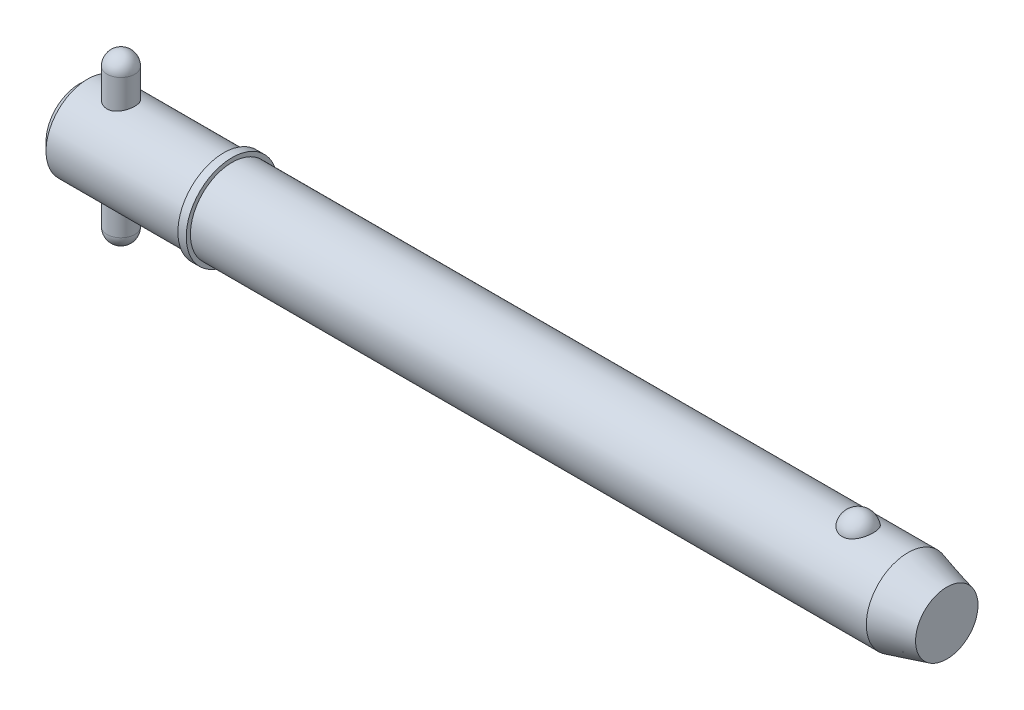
ISO-10303-21;
HEADER;
FILE_DESCRIPTION(('STEP AP214'),'2;1');
FILE_NAME('part.step','',(''),(''),'','','');
FILE_SCHEMA(('AUTOMOTIVE_DESIGN { 1 0 10303 214 1 1 1 1 }'));
ENDSEC;
DATA;
#1=APPLICATION_CONTEXT('core data for automotive mechanical design processes');
#2=APPLICATION_PROTOCOL_DEFINITION('international standard','automotive_design',2000,#1);
#3=PRODUCT_CONTEXT('',#1,'mechanical');
#4=PRODUCT('Part','Part','',(#3));
#5=PRODUCT_RELATED_PRODUCT_CATEGORY('part','',(#4));
#6=PRODUCT_DEFINITION_FORMATION('','',#4);
#7=PRODUCT_DEFINITION_CONTEXT('part definition',#1,'design');
#8=PRODUCT_DEFINITION('design','',#6,#7);
#9=PRODUCT_DEFINITION_SHAPE('','',#8);
#10=(LENGTH_UNIT() NAMED_UNIT(*) SI_UNIT(.MILLI.,.METRE.));
#11=(NAMED_UNIT(*) PLANE_ANGLE_UNIT() SI_UNIT($,.RADIAN.));
#12=(NAMED_UNIT(*) SI_UNIT($,.STERADIAN.) SOLID_ANGLE_UNIT());
#13=UNCERTAINTY_MEASURE_WITH_UNIT(LENGTH_MEASURE(1.E-05),#10,'distance_accuracy_value','');
#14=(GEOMETRIC_REPRESENTATION_CONTEXT(3) GLOBAL_UNCERTAINTY_ASSIGNED_CONTEXT((#13)) GLOBAL_UNIT_ASSIGNED_CONTEXT((#10,
#11,#12)) REPRESENTATION_CONTEXT('',''));
#15=CARTESIAN_POINT('',(0.,0.,0.));
#16=DIRECTION('',(0.,0.,1.));
#17=DIRECTION('',(1.,0.,0.));
#18=AXIS2_PLACEMENT_3D('',#15,#16,#17);
#19=CARTESIAN_POINT('',(9.525,19.05,0.));
#20=DIRECTION('',(0.,-1.,0.));
#21=DIRECTION('',(0.,0.,-1.));
#22=AXIS2_PLACEMENT_3D('',#19,#20,#21);
#23=CYLINDRICAL_SURFACE('',#22,3.175);
#24=CARTESIAN_POINT('',(9.525,-15.875,0.));
#25=DIRECTION('',(0.,-1.,0.));
#26=DIRECTION('',(0.,0.,-1.));
#27=AXIS2_PLACEMENT_3D('',#24,#25,#26);
#28=CIRCLE('',#27,3.175);
#29=CARTESIAN_POINT('',(9.525,-15.875,-3.175));
#30=VERTEX_POINT('',#29);
#31=EDGE_CURVE('P0_E10',#30,#30,#28,.F.);
#32=CARTESIAN_POINT('',(9.525,15.875,0.));
#33=DIRECTION('',(0.,-1.,0.));
#34=DIRECTION('',(0.,0.,-1.));
#35=AXIS2_PLACEMENT_3D('',#32,#33,#34);
#36=CIRCLE('',#35,3.175);
#37=CARTESIAN_POINT('',(9.525,15.875,-3.175));
#38=VERTEX_POINT('',#37);
#39=EDGE_CURVE('P0_E21',#38,#38,#36,.T.);
#40=CARTESIAN_POINT('',(9.525,-15.875,-3.175));
#41=CARTESIAN_POINT('',(9.525,-15.5442708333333,-3.175));
#42=CARTESIAN_POINT('',(9.525,-15.2135416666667,-3.175));
#43=CARTESIAN_POINT('',(9.525,-14.5520833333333,-3.175));
#44=CARTESIAN_POINT('',(9.525,-14.2213541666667,-3.175));
#45=CARTESIAN_POINT('',(9.525,-13.5598958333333,-3.175));
#46=CARTESIAN_POINT('',(9.525,-13.2291666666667,-3.175));
#47=CARTESIAN_POINT('',(9.525,-12.5677083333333,-3.175));
#48=CARTESIAN_POINT('',(9.525,-12.2369791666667,-3.175));
#49=CARTESIAN_POINT('',(9.525,-11.5755208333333,-3.175));
#50=CARTESIAN_POINT('',(9.525,-11.2447916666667,-3.175));
#51=CARTESIAN_POINT('',(9.525,-10.5833333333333,-3.175));
#52=CARTESIAN_POINT('',(9.525,-10.2526041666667,-3.175));
#53=CARTESIAN_POINT('',(9.525,-9.59114583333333,-3.175));
#54=CARTESIAN_POINT('',(9.525,-9.26041666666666,-3.175));
#55=CARTESIAN_POINT('',(9.525,-8.59895833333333,-3.175));
#56=CARTESIAN_POINT('',(9.525,-8.26822916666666,-3.175));
#57=CARTESIAN_POINT('',(9.525,-7.60677083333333,-3.175));
#58=CARTESIAN_POINT('',(9.525,-7.27604166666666,-3.175));
#59=CARTESIAN_POINT('',(9.525,-6.61458333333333,-3.175));
#60=CARTESIAN_POINT('',(9.525,-6.28385416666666,-3.175));
#61=CARTESIAN_POINT('',(9.525,-5.62239583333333,-3.175));
#62=CARTESIAN_POINT('',(9.525,-5.29166666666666,-3.175));
#63=CARTESIAN_POINT('',(9.525,-4.63020833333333,-3.175));
#64=CARTESIAN_POINT('',(9.525,-4.29947916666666,-3.175));
#65=CARTESIAN_POINT('',(9.525,-3.63802083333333,-3.175));
#66=CARTESIAN_POINT('',(9.525,-3.30729166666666,-3.175));
#67=CARTESIAN_POINT('',(9.525,-2.64583333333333,-3.175));
#68=CARTESIAN_POINT('',(9.525,-2.31510416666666,-3.175));
#69=CARTESIAN_POINT('',(9.525,-1.65364583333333,-3.175));
#70=CARTESIAN_POINT('',(9.525,-1.32291666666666,-3.175));
#71=CARTESIAN_POINT('',(9.525,-0.661458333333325,-3.175));
#72=CARTESIAN_POINT('',(9.525,-0.330729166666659,-3.175));
#73=CARTESIAN_POINT('',(9.525,0.330729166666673,-3.175));
#74=CARTESIAN_POINT('',(9.525,0.661458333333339,-3.175));
#75=CARTESIAN_POINT('',(9.525,1.32291666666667,-3.175));
#76=CARTESIAN_POINT('',(9.525,1.65364583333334,-3.175));
#77=CARTESIAN_POINT('',(9.525,2.31510416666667,-3.175));
#78=CARTESIAN_POINT('',(9.525,2.64583333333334,-3.175));
#79=CARTESIAN_POINT('',(9.525,3.30729166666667,-3.175));
#80=CARTESIAN_POINT('',(9.525,3.63802083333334,-3.175));
#81=CARTESIAN_POINT('',(9.525,4.29947916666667,-3.175));
#82=CARTESIAN_POINT('',(9.525,4.63020833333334,-3.175));
#83=CARTESIAN_POINT('',(9.525,5.29166666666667,-3.175));
#84=CARTESIAN_POINT('',(9.525,5.62239583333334,-3.175));
#85=CARTESIAN_POINT('',(9.525,6.28385416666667,-3.175));
#86=CARTESIAN_POINT('',(9.525,6.61458333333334,-3.175));
#87=CARTESIAN_POINT('',(9.525,7.27604166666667,-3.175));
#88=CARTESIAN_POINT('',(9.525,7.60677083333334,-3.175));
#89=CARTESIAN_POINT('',(9.525,8.26822916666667,-3.175));
#90=CARTESIAN_POINT('',(9.525,8.59895833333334,-3.175));
#91=CARTESIAN_POINT('',(9.525,9.26041666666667,-3.175));
#92=CARTESIAN_POINT('',(9.525,9.59114583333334,-3.175));
#93=CARTESIAN_POINT('',(9.525,10.2526041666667,-3.175));
#94=CARTESIAN_POINT('',(9.525,10.5833333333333,-3.175));
#95=CARTESIAN_POINT('',(9.525,11.2447916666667,-3.175));
#96=CARTESIAN_POINT('',(9.525,11.5755208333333,-3.175));
#97=CARTESIAN_POINT('',(9.525,12.2369791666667,-3.175));
#98=CARTESIAN_POINT('',(9.525,12.5677083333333,-3.175));
#99=CARTESIAN_POINT('',(9.525,13.2291666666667,-3.175));
#100=CARTESIAN_POINT('',(9.525,13.5598958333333,-3.175));
#101=CARTESIAN_POINT('',(9.525,14.2213541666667,-3.175));
#102=CARTESIAN_POINT('',(9.525,14.5520833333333,-3.175));
#103=CARTESIAN_POINT('',(9.525,15.2135416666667,-3.175));
#104=CARTESIAN_POINT('',(9.525,15.5442708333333,-3.175));
#105=CARTESIAN_POINT('',(9.525,15.875,-3.175));
#106=B_SPLINE_CURVE_WITH_KNOTS('',3,(#40,#41,#42,#43,#44,#45,#46,#47,#48,#49,#50,#51,#52,#53,
#54,#55,#56,#57,#58,#59,#60,#61,#62,#63,#64,#65,#66,#67,#68,#69,#70,#71,#72,#73,#74,#75,#76,#77,
#78,#79,#80,#81,#82,#83,#84,#85,#86,#87,#88,#89,#90,#91,#92,#93,#94,#95,#96,#97,#98,#99,#100,
#101,#102,#103,#104,#105),.UNSPECIFIED.,.F.,.F.,(4,2,2,2,2,2,2,2,2,2,2,2,2,2,2,2,2,2,2,2,2,2,2,
2,2,2,2,2,2,2,2,2,4),(0.,0.992187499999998,1.984375,2.9765625,3.96875,4.96093749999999,5.953125,
6.9453125,7.9375,8.92968749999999,9.921875,10.9140625,11.90625,12.8984375,13.890625,14.8828125,
15.875,16.8671875,17.859375,18.8515625,19.84375,20.8359375,21.828125,22.8203125,23.8125,
24.8046875,25.796875,26.7890625,27.78125,28.7734375,29.765625,30.7578125,31.75),.UNSPECIFIED.);
#107=EDGE_CURVE('P0_BSEAM14',#30,#38,#106,.T.);
#108=ORIENTED_EDGE('',*,*,#31,.T.);
#109=ORIENTED_EDGE('',*,*,#39,.T.);
#110=ORIENTED_EDGE('',*,*,#107,.T.);
#111=ORIENTED_EDGE('',*,*,#107,.F.);
#112=EDGE_LOOP('',(#108,#110,#109,#111));
#113=FACE_BOUND('',#112,.T.);
#114=ADVANCED_FACE('P0_F14',(#113),#23,.T.);
#115=CARTESIAN_POINT('',(9.525,-15.875,0.));
#116=DIRECTION('',(0.,0.,1.));
#117=DIRECTION('',(1.,0.,0.));
#118=AXIS2_PLACEMENT_3D('',#115,#116,#117);
#119=SPHERICAL_SURFACE('',#118,3.175);
#120=CARTESIAN_POINT('',(9.525,-15.875,0.));
#121=DIRECTION('',(0.,-1.,0.));
#122=DIRECTION('',(0.,0.,-1.));
#123=AXIS2_PLACEMENT_3D('',#120,#121,#122);
#124=SPHERICAL_SURFACE('',#123,3.175);
#125=ORIENTED_EDGE('',*,*,#31,.F.);
#126=EDGE_LOOP('',(#125));
#127=FACE_BOUND('',#126,.T.);
#128=ADVANCED_FACE('P0_F29',(#127),#124,.T.);
#129=CARTESIAN_POINT('',(9.525,15.875,0.));
#130=DIRECTION('',(0.,0.,1.));
#131=DIRECTION('',(1.,0.,0.));
#132=AXIS2_PLACEMENT_3D('',#129,#130,#131);
#133=SPHERICAL_SURFACE('',#132,3.175);
#134=CARTESIAN_POINT('',(9.525,15.875,0.));
#135=DIRECTION('',(0.,-1.,0.));
#136=DIRECTION('',(0.,0.,-1.));
#137=AXIS2_PLACEMENT_3D('',#134,#135,#136);
#138=SPHERICAL_SURFACE('',#137,3.175);
#139=ORIENTED_EDGE('',*,*,#39,.F.);
#140=EDGE_LOOP('',(#139));
#141=FACE_BOUND('',#140,.T.);
#142=ADVANCED_FACE('P0_F16',(#141),#138,.T.);
#143=CLOSED_SHELL('',(#114,#128,#142));
#144=MANIFOLD_SOLID_BREP('P0_B1',#143);
#145=CARTESIAN_POINT('',(0.,0.,0.));
#146=DIRECTION('',(1.,0.,0.));
#147=DIRECTION('',(0.,0.,-1.));
#148=AXIS2_PLACEMENT_3D('',#145,#146,#147);
#149=CYLINDRICAL_SURFACE('',#148,9.525);
#150=CARTESIAN_POINT('',(189.543054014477,0.,0.));
#151=DIRECTION('',(1.,0.,0.));
#152=DIRECTION('',(0.,0.,-1.));
#153=AXIS2_PLACEMENT_3D('',#150,#151,#152);
#154=CIRCLE('',#153,9.525);
#155=CARTESIAN_POINT('',(189.543054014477,0.,-9.525));
#156=VERTEX_POINT('',#155);
#157=EDGE_CURVE('P1_E81',#156,#156,#154,.T.);
#158=ORIENTED_EDGE('',*,*,#157,.F.);
#159=EDGE_LOOP('',(#158));
#160=FACE_BOUND('',#159,.T.);
#161=CARTESIAN_POINT('',(34.93,0.,0.));
#162=DIRECTION('',(1.,0.,0.));
#163=DIRECTION('',(0.,0.,-1.));
#164=AXIS2_PLACEMENT_3D('',#161,#162,#163);
#165=CIRCLE('',#164,9.525);
#166=CARTESIAN_POINT('',(34.93,0.,-9.525));
#167=VERTEX_POINT('',#166);
#168=EDGE_CURVE('P1_E85',#167,#167,#165,.T.);
#169=ORIENTED_EDGE('',*,*,#168,.T.);
#170=EDGE_LOOP('',(#169));
#171=FACE_BOUND('',#170,.T.);
#172=CARTESIAN_POINT('',(178.145757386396,8.80405803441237,3.63513233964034));
#173=CARTESIAN_POINT('',(178.051676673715,8.80405953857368,3.63513053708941));
#174=CARTESIAN_POINT('',(177.957561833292,8.80561325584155,3.63137461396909));
#175=CARTESIAN_POINT('',(177.770012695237,8.81177748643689,3.61638665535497));
#176=CARTESIAN_POINT('',(177.676578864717,8.81638992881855,3.60514990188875));
#177=CARTESIAN_POINT('',(177.397945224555,8.83467114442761,3.56024627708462));
#178=CARTESIAN_POINT('',(177.214691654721,8.85278327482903,3.5153862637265));
#179=CARTESIAN_POINT('',(176.859509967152,8.89871214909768,3.39742145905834));
#180=CARTESIAN_POINT('',(176.687553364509,8.92650327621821,3.32439116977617));
#181=CARTESIAN_POINT('',(176.358707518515,8.9887481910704,3.15220244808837));
#182=CARTESIAN_POINT('',(176.201811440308,9.02319893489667,3.05305594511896));
#183=CARTESIAN_POINT('',(175.902214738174,9.09629186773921,2.82797815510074));
#184=CARTESIAN_POINT('',(175.760060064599,9.13502685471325,2.70135138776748));
#185=CARTESIAN_POINT('',(175.498299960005,9.2118657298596,2.42641932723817));
#186=CARTESIAN_POINT('',(175.378701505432,9.24996941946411,2.27810735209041));
#187=CARTESIAN_POINT('',(175.159645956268,9.32341082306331,1.95652290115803));
#188=CARTESIAN_POINT('',(175.061317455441,9.35855090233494,1.78243511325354));
#189=CARTESIAN_POINT('',(174.893819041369,9.42045142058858,1.41937246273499));
#190=CARTESIAN_POINT('',(174.824651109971,9.44721128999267,1.23039658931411));
#191=CARTESIAN_POINT('',(174.716199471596,9.48990641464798,0.840370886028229));
#192=CARTESIAN_POINT('',(174.677288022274,9.50570658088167,0.639202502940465));
#193=CARTESIAN_POINT('',(174.631555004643,9.52433146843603,0.232664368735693));
#194=CARTESIAN_POINT('',(174.624732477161,9.52715657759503,0.0272947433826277));
#195=CARTESIAN_POINT('',(174.643255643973,9.51956918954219,-0.380478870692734));
#196=CARTESIAN_POINT('',(174.668405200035,9.50923740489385,-0.582893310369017));
#197=CARTESIAN_POINT('',(174.75002537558,9.47651897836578,-0.980293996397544));
#198=CARTESIAN_POINT('',(174.806496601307,9.45413210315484,-1.17528009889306));
#199=CARTESIAN_POINT('',(174.949719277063,9.39954044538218,-1.55263697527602));
#200=CARTESIAN_POINT('',(175.036512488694,9.36732213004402,-1.73498993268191));
#201=CARTESIAN_POINT('',(175.238610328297,9.29640700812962,-2.08177763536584));
#202=CARTESIAN_POINT('',(175.353917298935,9.25770966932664,-2.24621090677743));
#203=CARTESIAN_POINT('',(175.611264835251,9.17775604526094,-2.5533833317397));
#204=CARTESIAN_POINT('',(175.753434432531,9.136488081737,-2.696011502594));
#205=CARTESIAN_POINT('',(176.06089985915,9.05620497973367,-2.95451229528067));
#206=CARTESIAN_POINT('',(176.226193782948,9.01718965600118,-3.07038711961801));
#207=CARTESIAN_POINT('',(176.572052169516,8.94680019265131,-3.26976836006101));
#208=CARTESIAN_POINT('',(176.752227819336,8.91528408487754,-3.35389750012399));
#209=CARTESIAN_POINT('',(177.125651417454,8.86272514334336,-3.49043503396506));
#210=CARTESIAN_POINT('',(177.318894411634,8.84167836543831,-3.54285537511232));
#211=CARTESIAN_POINT('',(177.702503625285,8.81348056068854,-3.61241306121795));
#212=CARTESIAN_POINT('',(177.892525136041,8.80568348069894,-3.6311933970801));
#213=CARTESIAN_POINT('',(178.273190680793,8.80289410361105,-3.63795342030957));
#214=CARTESIAN_POINT('',(178.463834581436,8.80789922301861,-3.62593932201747));
#215=CARTESIAN_POINT('',(178.834007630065,8.82974915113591,-3.57238430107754));
#216=CARTESIAN_POINT('',(179.013697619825,8.84621463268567,-3.53178890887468));
#217=CARTESIAN_POINT('',(179.363422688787,8.88875330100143,-3.42331083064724));
#218=CARTESIAN_POINT('',(179.533456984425,8.91482726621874,-3.35542593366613));
#219=CARTESIAN_POINT('',(179.863237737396,8.97448239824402,-3.19248225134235));
#220=CARTESIAN_POINT('',(180.022680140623,9.00821446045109,-3.0968647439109));
#221=CARTESIAN_POINT('',(180.323513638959,9.07935398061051,-2.88162736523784));
#222=CARTESIAN_POINT('',(180.464900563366,9.11676228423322,-2.76200196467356));
#223=CARTESIAN_POINT('',(180.73331931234,9.19347419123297,-2.49516285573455));
#224=CARTESIAN_POINT('',(180.859275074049,9.23277872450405,-2.34686614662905));
#225=CARTESIAN_POINT('',(181.085522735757,9.3073761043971,-2.03093683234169));
#226=CARTESIAN_POINT('',(181.18581004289,9.34266823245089,-1.86330077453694));
#227=CARTESIAN_POINT('',(181.361514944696,9.40674710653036,-1.50744893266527));
#228=CARTESIAN_POINT('',(181.436041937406,9.43529176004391,-1.31874876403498));
#229=CARTESIAN_POINT('',(181.55416505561,9.48144132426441,-0.930631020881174));
#230=CARTESIAN_POINT('',(181.597760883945,9.49904612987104,-0.731213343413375));
#231=CARTESIAN_POINT('',(181.653158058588,9.5215314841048,-0.327147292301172));
#232=CARTESIAN_POINT('',(181.664935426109,9.52640243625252,-0.122495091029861));
#233=CARTESIAN_POINT('',(181.656382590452,9.5228957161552,0.28601848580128));
#234=CARTESIAN_POINT('',(181.63605305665,9.5145183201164,0.489879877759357));
#235=CARTESIAN_POINT('',(181.563884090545,9.48544083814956,0.889994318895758));
#236=CARTESIAN_POINT('',(181.512199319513,9.46480124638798,1.08627971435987));
#237=CARTESIAN_POINT('',(181.378491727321,9.4133389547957,1.46682086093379));
#238=CARTESIAN_POINT('',(181.296466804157,9.38251554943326,1.65107577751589));
#239=CARTESIAN_POINT('',(181.10319292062,9.31365636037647,2.00346348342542));
#240=CARTESIAN_POINT('',(180.991783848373,9.27558138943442,2.17150083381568));
#241=CARTESIAN_POINT('',(180.742294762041,9.19638714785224,2.48563115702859));
#242=CARTESIAN_POINT('',(180.604216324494,9.15526805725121,2.63172542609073));
#243=CARTESIAN_POINT('',(180.304843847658,9.07465393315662,2.89750997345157));
#244=CARTESIAN_POINT('',(180.143610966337,9.03515496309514,3.01726776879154));
#245=CARTESIAN_POINT('',(179.801613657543,8.96227564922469,3.22732920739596));
#246=CARTESIAN_POINT('',(179.620841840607,8.92889763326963,3.31762165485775));
#247=CARTESIAN_POINT('',(179.251445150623,8.8734538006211,3.46314419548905));
#248=CARTESIAN_POINT('',(179.06332371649,8.85102983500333,3.51950082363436));
#249=CARTESIAN_POINT('',(178.77578699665,8.8266696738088,3.57993683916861));
#250=CARTESIAN_POINT('',(178.679133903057,8.82009725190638,3.5960621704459));
#251=CARTESIAN_POINT('',(178.484677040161,8.81020897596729,3.62022512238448));
#252=CARTESIAN_POINT('',(178.386874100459,8.80689090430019,3.62826825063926));
#253=CARTESIAN_POINT('',(178.241224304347,8.80445615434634,3.63416760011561));
#254=CARTESIAN_POINT('',(178.193495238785,8.80405727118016,3.63513325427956));
#255=CARTESIAN_POINT('',(178.145757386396,8.80405803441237,3.63513233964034));
#256=B_SPLINE_CURVE_WITH_KNOTS('',3,(#172,#173,#174,#175,#176,#177,#178,#179,#180,#181,#182,
#183,#184,#185,#186,#187,#188,#189,#190,#191,#192,#193,#194,#195,#196,#197,#198,#199,#200,#201,
#202,#203,#204,#205,#206,#207,#208,#209,#210,#211,#212,#213,#214,#215,#216,#217,#218,#219,#220,
#221,#222,#223,#224,#225,#226,#227,#228,#229,#230,#231,#232,#233,#234,#235,#236,#237,#238,#239,
#240,#241,#242,#243,#244,#245,#246,#247,#248,#249,#250,#251,#252,#253,#254,#255),.UNSPECIFIED.,
.T.,.F.,(4,2,2,2,2,2,2,2,2,2,2,2,2,2,2,2,2,2,2,2,2,2,2,2,2,2,2,2,2,2,2,2,2,2,2,2,2,2,2,2,2,4),
(0.,0.282202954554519,0.564584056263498,1.13017050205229,1.69427128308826,2.25811483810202,
2.83836627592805,3.41879688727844,4.02497117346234,4.63118665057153,5.24474754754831,
5.85829010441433,6.46808687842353,7.07789545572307,7.68854723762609,8.299249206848,
8.91296283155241,9.52662591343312,10.1275338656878,10.7282152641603,11.2986646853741,
11.8689989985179,12.4213015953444,12.973648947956,13.5380053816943,14.1024919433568,
14.695298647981,15.2882113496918,15.8999469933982,16.5116885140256,17.1238909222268,
17.7360805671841,18.3452748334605,18.9545113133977,19.567138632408,20.179729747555,
20.7907316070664,21.4019653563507,21.9915938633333,22.2859053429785,22.5800161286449,
22.7232098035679),.UNSPECIFIED.);
#257=CARTESIAN_POINT('',(178.145757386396,8.80405803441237,3.63513233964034));
#258=VERTEX_POINT('',#257);
#259=EDGE_CURVE('P1_E35',#258,#258,#256,.T.);
#260=ORIENTED_EDGE('',*,*,#259,.T.);
#261=EDGE_LOOP('',(#260));
#262=FACE_BOUND('',#261,.T.);
#263=ADVANCED_FACE('P1_F13',(#160,#171,#262),#149,.T.);
#264=CARTESIAN_POINT('',(0.,0.,0.));
#265=DIRECTION('',(-1.,0.,0.));
#266=DIRECTION('',(0.,0.,1.));
#267=AXIS2_PLACEMENT_3D('',#264,#265,#266);
#268=PLANE('',#267);
#269=CARTESIAN_POINT('',(0.,0.,0.));
#270=DIRECTION('',(1.,0.,0.));
#271=DIRECTION('',(0.,0.,-1.));
#272=AXIS2_PLACEMENT_3D('',#269,#270,#271);
#273=CIRCLE('',#272,7.62);
#274=CARTESIAN_POINT('',(0.,0.,-7.62));
#275=VERTEX_POINT('',#274);
#276=EDGE_CURVE('P1_E9',#275,#275,#273,.T.);
#277=ORIENTED_EDGE('',*,*,#276,.F.);
#278=EDGE_LOOP('',(#277));
#279=FACE_BOUND('',#278,.T.);
#280=ADVANCED_FACE('P1_F15',(#279),#268,.T.);
#281=CARTESIAN_POINT('',(1.90499999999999,0.,0.));
#282=DIRECTION('',(1.,0.,0.));
#283=DIRECTION('',(0.,0.,-1.));
#284=AXIS2_PLACEMENT_3D('',#281,#282,#283);
#285=CONICAL_SURFACE('',#284,9.525,0.785398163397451);
#286=ORIENTED_EDGE('',*,*,#276,.T.);
#287=EDGE_LOOP('',(#286));
#288=FACE_BOUND('',#287,.T.);
#289=CARTESIAN_POINT('',(1.90499999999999,0.,0.));
#290=DIRECTION('',(1.,0.,0.));
#291=DIRECTION('',(0.,0.,-1.));
#292=AXIS2_PLACEMENT_3D('',#289,#290,#291);
#293=CIRCLE('',#292,9.525);
#294=CARTESIAN_POINT('',(1.90499999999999,0.,-9.525));
#295=VERTEX_POINT('',#294);
#296=EDGE_CURVE('P1_E26',#295,#295,#293,.T.);
#297=ORIENTED_EDGE('',*,*,#296,.F.);
#298=EDGE_LOOP('',(#297));
#299=FACE_BOUND('',#298,.T.);
#300=ADVANCED_FACE('P1_F77',(#288,#299),#285,.T.);
#301=CARTESIAN_POINT('',(0.,0.,0.));
#302=DIRECTION('',(1.,0.,0.));
#303=DIRECTION('',(0.,0.,-1.));
#304=AXIS2_PLACEMENT_3D('',#301,#302,#303);
#305=CYLINDRICAL_SURFACE('',#304,9.525);
#306=CARTESIAN_POINT('',(9.525,-8.98025612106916,3.175));
#307=CARTESIAN_POINT('',(9.35206354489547,-8.98025555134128,3.17500081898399));
#308=CARTESIAN_POINT('',(9.17913201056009,-8.98530617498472,3.16082293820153));
#309=CARTESIAN_POINT('',(8.83839221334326,-9.00485797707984,3.10467734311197));
#310=CARTESIAN_POINT('',(8.67058479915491,-9.0193607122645,3.06270505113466));
#311=CARTESIAN_POINT('',(8.34508461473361,-9.05599546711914,2.95260866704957));
#312=CARTESIAN_POINT('',(8.18737272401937,-9.07811252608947,2.88453582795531));
#313=CARTESIAN_POINT('',(7.88555684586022,-9.12746212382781,2.72434567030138));
#314=CARTESIAN_POINT('',(7.74145587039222,-9.1546957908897,2.63222304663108));
#315=CARTESIAN_POINT('',(7.46531411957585,-9.21240503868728,2.42268738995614));
#316=CARTESIAN_POINT('',(7.33388351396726,-9.24296141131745,2.30449228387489));
#317=CARTESIAN_POINT('',(7.09229340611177,-9.30319020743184,2.0478358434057));
#318=CARTESIAN_POINT('',(6.98213731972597,-9.33286248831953,1.90937126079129));
#319=CARTESIAN_POINT('',(6.78345450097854,-9.38891527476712,1.61164431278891));
#320=CARTESIAN_POINT('',(6.69556709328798,-9.41518969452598,1.45193356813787));
#321=CARTESIAN_POINT('',(6.54814671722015,-9.46053437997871,1.11896913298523));
#322=CARTESIAN_POINT('',(6.48860610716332,-9.47960658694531,0.945719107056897));
#323=CARTESIAN_POINT('',(6.40163866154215,-9.50782564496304,0.596991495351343));
#324=CARTESIAN_POINT('',(6.373166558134,-9.5172947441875,0.421801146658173));
#325=CARTESIAN_POINT('',(6.3458207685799,-9.52638456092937,0.068890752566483));
#326=CARTESIAN_POINT('',(6.34693945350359,-9.52600781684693,-0.108828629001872));
#327=CARTESIAN_POINT('',(6.37808050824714,-9.51566675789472,-0.454353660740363));
#328=CARTESIAN_POINT('',(6.4069675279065,-9.50607905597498,-0.622274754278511));
#329=CARTESIAN_POINT('',(6.490947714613,-9.47886621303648,-0.950732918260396));
#330=CARTESIAN_POINT('',(6.54604265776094,-9.46124052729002,-1.11126948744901));
#331=CARTESIAN_POINT('',(6.68153768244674,-9.41945253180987,-1.42288410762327));
#332=CARTESIAN_POINT('',(6.76226085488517,-9.3952073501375,-1.57381010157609));
#333=CARTESIAN_POINT('',(6.94645456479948,-9.34270397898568,-1.86030973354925));
#334=CARTESIAN_POINT('',(7.04993142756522,-9.31444467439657,-1.99587908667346));
#335=CARTESIAN_POINT('',(7.28241619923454,-9.25532159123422,-2.2545702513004));
#336=CARTESIAN_POINT('',(7.4123967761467,-9.22439783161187,-2.37680549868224));
#337=CARTESIAN_POINT('',(7.69127470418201,-9.1645528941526,-2.5980302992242));
#338=CARTESIAN_POINT('',(7.84017496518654,-9.13563202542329,-2.6970162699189));
#339=CARTESIAN_POINT('',(8.15547526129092,-9.08273917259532,-2.87016016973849));
#340=CARTESIAN_POINT('',(8.32209451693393,-9.05884361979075,-2.94394402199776));
#341=CARTESIAN_POINT('',(8.66638917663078,-9.01959241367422,-3.06210713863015));
#342=CARTESIAN_POINT('',(8.84405991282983,-9.00423318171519,-3.10649872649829));
#343=CARTESIAN_POINT('',(9.19682677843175,-8.98460345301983,-3.16281207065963));
#344=CARTESIAN_POINT('',(9.37167742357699,-8.9798639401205,-3.17610837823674));
#345=CARTESIAN_POINT('',(9.72113927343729,-8.9806993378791,-3.17374726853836));
#346=CARTESIAN_POINT('',(9.89575051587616,-8.98627237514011,-3.15809511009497));
#347=CARTESIAN_POINT('',(10.2335233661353,-9.00663737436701,-3.09951644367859));
#348=CARTESIAN_POINT('',(10.3968722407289,-9.02110608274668,-3.05754530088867));
#349=CARTESIAN_POINT('',(10.7141759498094,-9.05727657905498,-2.94866651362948));
#350=CARTESIAN_POINT('',(10.8681291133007,-9.07897964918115,-2.88175444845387));
#351=CARTESIAN_POINT('',(11.1676828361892,-9.12802586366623,-2.72248103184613));
#352=CARTESIAN_POINT('',(11.3128635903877,-9.1555260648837,-2.62937980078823));
#353=CARTESIAN_POINT('',(11.5860387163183,-9.21276315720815,-2.42120937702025));
#354=CARTESIAN_POINT('',(11.7140280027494,-9.24250070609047,-2.30613370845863));
#355=CARTESIAN_POINT('',(11.9555513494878,-9.30259247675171,-2.05070616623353));
#356=CARTESIAN_POINT('',(12.0680936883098,-9.33290753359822,-1.90940458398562));
#357=CARTESIAN_POINT('',(12.267933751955,-9.3893275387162,-1.60917665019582));
#358=CARTESIAN_POINT('',(12.3552323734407,-9.41543263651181,-1.45025092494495));
#359=CARTESIAN_POINT('',(12.5013088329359,-9.46036988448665,-1.12007606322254));
#360=CARTESIAN_POINT('',(12.5602723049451,-9.47924920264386,-0.9489158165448));
#361=CARTESIAN_POINT('',(12.6483355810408,-9.50781089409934,-0.598355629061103));
#362=CARTESIAN_POINT('',(12.6774461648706,-9.5174965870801,-0.4189586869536));
#363=CARTESIAN_POINT('',(12.7040070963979,-9.52632915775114,-0.066088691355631));
#364=CARTESIAN_POINT('',(12.7028811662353,-9.52594996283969,0.107266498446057));
#365=CARTESIAN_POINT('',(12.6725130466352,-9.51586223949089,0.451202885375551));
#366=CARTESIAN_POINT('',(12.643273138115,-9.50615446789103,0.621784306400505));
#367=CARTESIAN_POINT('',(12.5584514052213,-9.47867404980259,0.952633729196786));
#368=CARTESIAN_POINT('',(12.5032953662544,-9.46103195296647,1.1130225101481));
#369=CARTESIAN_POINT('',(12.3686013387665,-9.41949985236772,1.42233126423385));
#370=CARTESIAN_POINT('',(12.2890589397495,-9.39560871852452,1.57124915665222));
#371=CARTESIAN_POINT('',(12.1044667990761,-9.34294133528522,1.85938800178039));
#372=CARTESIAN_POINT('',(11.9985831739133,-9.31401720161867,1.9980473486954));
#373=CARTESIAN_POINT('',(11.7657327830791,-9.25490239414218,2.25609475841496));
#374=CARTESIAN_POINT('',(11.6387592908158,-9.22471131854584,2.37547664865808));
#375=CARTESIAN_POINT('',(11.3613902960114,-9.16505913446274,2.59633024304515));
#376=CARTESIAN_POINT('',(11.2102725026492,-9.13567286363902,2.69691791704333));
#377=CARTESIAN_POINT('',(10.8923631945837,-9.08241113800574,2.87119803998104));
#378=CARTESIAN_POINT('',(10.7255757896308,-9.05853424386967,2.94489751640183));
#379=CARTESIAN_POINT('',(10.3887212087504,-9.02021736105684,3.06020415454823));
#380=CARTESIAN_POINT('',(10.219143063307,-9.00539959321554,3.10311136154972));
#381=CARTESIAN_POINT('',(9.87470703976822,-8.98542092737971,3.16050396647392));
#382=CARTESIAN_POINT('',(9.699851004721,-8.98025669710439,3.17499917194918));
#383=CARTESIAN_POINT('',(9.525,-8.98025612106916,3.175));
#384=B_SPLINE_CURVE_WITH_KNOTS('',3,(#306,#307,#308,#309,#310,#311,#312,#313,#314,#315,#316,
#317,#318,#319,#320,#321,#322,#323,#324,#325,#326,#327,#328,#329,#330,#331,#332,#333,#334,#335,
#336,#337,#338,#339,#340,#341,#342,#343,#344,#345,#346,#347,#348,#349,#350,#351,#352,#353,#354,
#355,#356,#357,#358,#359,#360,#361,#362,#363,#364,#365,#366,#367,#368,#369,#370,#371,#372,#373,
#374,#375,#376,#377,#378,#379,#380,#381,#382,#383),.UNSPECIFIED.,.T.,.F.,(4,2,2,2,2,2,2,2,2,2,2,
2,2,2,2,2,2,2,2,2,2,2,2,2,2,2,2,2,2,2,2,2,2,2,2,2,2,2,4),(0.,0.518161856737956,1.03640907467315,
1.55364379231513,2.07099270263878,2.60671746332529,3.14252816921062,3.69231882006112,
4.24196117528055,4.77247962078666,5.30286129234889,5.81244090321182,6.32205505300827,
6.83836754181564,7.3548237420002,7.89559553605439,8.43645060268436,8.98501631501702,
9.53335188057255,10.056948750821,10.5804505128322,11.0859695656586,11.5915782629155,
12.1132237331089,12.6350231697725,13.1819271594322,13.7288117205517,14.2720628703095,
14.815117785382,15.3326491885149,15.8501386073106,16.3594083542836,16.868770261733,
17.3969527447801,17.925304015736,18.4743376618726,19.023227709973,19.5473069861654,
20.0712053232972),.UNSPECIFIED.);
#385=CARTESIAN_POINT('',(9.525,-8.98025612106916,3.175));
#386=VERTEX_POINT('',#385);
#387=EDGE_CURVE('P1_E17',#386,#386,#384,.T.);
#388=ORIENTED_EDGE('',*,*,#387,.F.);
#389=EDGE_LOOP('',(#388));
#390=FACE_BOUND('',#389,.T.);
#391=CARTESIAN_POINT('',(9.525,8.98025612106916,3.175));
#392=CARTESIAN_POINT('',(9.69793645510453,8.98025555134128,3.17500081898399));
#393=CARTESIAN_POINT('',(9.87086798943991,8.98530617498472,3.16082293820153));
#394=CARTESIAN_POINT('',(10.2116077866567,9.00485797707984,3.10467734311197));
#395=CARTESIAN_POINT('',(10.3794152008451,9.0193607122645,3.06270505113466));
#396=CARTESIAN_POINT('',(10.7049153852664,9.05599546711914,2.95260866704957));
#397=CARTESIAN_POINT('',(10.8626272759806,9.07811252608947,2.88453582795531));
#398=CARTESIAN_POINT('',(11.1644431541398,9.12746212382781,2.72434567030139));
#399=CARTESIAN_POINT('',(11.3085441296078,9.15469579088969,2.63222304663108));
#400=CARTESIAN_POINT('',(11.5846858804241,9.21240503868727,2.42268738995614));
#401=CARTESIAN_POINT('',(11.7161164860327,9.24296141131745,2.30449228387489));
#402=CARTESIAN_POINT('',(11.9577065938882,9.30319020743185,2.0478358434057));
#403=CARTESIAN_POINT('',(12.067862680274,9.33286248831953,1.90937126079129));
#404=CARTESIAN_POINT('',(12.2665454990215,9.38891527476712,1.61164431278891));
#405=CARTESIAN_POINT('',(12.354432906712,9.41518969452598,1.45193356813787));
#406=CARTESIAN_POINT('',(12.5018532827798,9.46053437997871,1.11896913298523));
#407=CARTESIAN_POINT('',(12.5613938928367,9.47960658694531,0.945719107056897));
#408=CARTESIAN_POINT('',(12.6483613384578,9.50782564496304,0.596991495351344));
#409=CARTESIAN_POINT('',(12.676833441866,9.5172947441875,0.421801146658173));
#410=CARTESIAN_POINT('',(12.7041792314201,9.52638456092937,0.0688907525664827));
#411=CARTESIAN_POINT('',(12.7030605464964,9.52600781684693,-0.108828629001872));
#412=CARTESIAN_POINT('',(12.6719194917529,9.51566675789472,-0.454353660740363));
#413=CARTESIAN_POINT('',(12.6430324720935,9.50607905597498,-0.622274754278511));
#414=CARTESIAN_POINT('',(12.559052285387,9.47886621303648,-0.950732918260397));
#415=CARTESIAN_POINT('',(12.5039573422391,9.46124052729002,-1.11126948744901));
#416=CARTESIAN_POINT('',(12.3684623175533,9.41945253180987,-1.42288410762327));
#417=CARTESIAN_POINT('',(12.2877391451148,9.3952073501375,-1.57381010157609));
#418=CARTESIAN_POINT('',(12.1035454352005,9.34270397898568,-1.86030973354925));
#419=CARTESIAN_POINT('',(12.0000685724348,9.31444467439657,-1.99587908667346));
#420=CARTESIAN_POINT('',(11.7675838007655,9.25532159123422,-2.2545702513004));
#421=CARTESIAN_POINT('',(11.6376032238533,9.22439783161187,-2.37680549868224));
#422=CARTESIAN_POINT('',(11.358725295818,9.1645528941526,-2.5980302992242));
#423=CARTESIAN_POINT('',(11.2098250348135,9.13563202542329,-2.6970162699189));
#424=CARTESIAN_POINT('',(10.8945247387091,9.08273917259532,-2.87016016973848));
#425=CARTESIAN_POINT('',(10.7279054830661,9.05884361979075,-2.94394402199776));
#426=CARTESIAN_POINT('',(10.3836108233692,9.01959241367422,-3.06210713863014));
#427=CARTESIAN_POINT('',(10.2059400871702,9.00423318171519,-3.10649872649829));
#428=CARTESIAN_POINT('',(9.85317322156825,8.98460345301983,-3.16281207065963));
#429=CARTESIAN_POINT('',(9.67832257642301,8.9798639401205,-3.17610837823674));
#430=CARTESIAN_POINT('',(9.32886072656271,8.9806993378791,-3.17374726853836));
#431=CARTESIAN_POINT('',(9.15424948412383,8.98627237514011,-3.15809511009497));
#432=CARTESIAN_POINT('',(8.81647663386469,9.00663737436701,-3.09951644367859));
#433=CARTESIAN_POINT('',(8.65312775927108,9.02110608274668,-3.05754530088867));
#434=CARTESIAN_POINT('',(8.33582405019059,9.05727657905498,-2.94866651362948));
#435=CARTESIAN_POINT('',(8.18187088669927,9.07897964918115,-2.88175444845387));
#436=CARTESIAN_POINT('',(7.88231716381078,9.12802586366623,-2.72248103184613));
#437=CARTESIAN_POINT('',(7.73713640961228,9.1555260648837,-2.62937980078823));
#438=CARTESIAN_POINT('',(7.46396128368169,9.21276315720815,-2.42120937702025));
#439=CARTESIAN_POINT('',(7.33597199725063,9.24250070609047,-2.30613370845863));
#440=CARTESIAN_POINT('',(7.09444865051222,9.30259247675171,-2.05070616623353));
#441=CARTESIAN_POINT('',(6.98190631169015,9.33290753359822,-1.90940458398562));
#442=CARTESIAN_POINT('',(6.78206624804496,9.3893275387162,-1.60917665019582));
#443=CARTESIAN_POINT('',(6.6947676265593,9.41543263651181,-1.45025092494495));
#444=CARTESIAN_POINT('',(6.54869116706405,9.46036988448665,-1.12007606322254));
#445=CARTESIAN_POINT('',(6.48972769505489,9.47924920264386,-0.948915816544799));
#446=CARTESIAN_POINT('',(6.40166441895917,9.50781089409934,-0.598355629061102));
#447=CARTESIAN_POINT('',(6.3725538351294,9.5174965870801,-0.418958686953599));
#448=CARTESIAN_POINT('',(6.34599290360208,9.52632915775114,-0.0660886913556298));
#449=CARTESIAN_POINT('',(6.3471188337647,9.52594996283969,0.107266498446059));
#450=CARTESIAN_POINT('',(6.37748695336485,9.51586223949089,0.451202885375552));
#451=CARTESIAN_POINT('',(6.40672686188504,9.50615446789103,0.621784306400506));
#452=CARTESIAN_POINT('',(6.49154859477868,9.47867404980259,0.952633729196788));
#453=CARTESIAN_POINT('',(6.54670463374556,9.46103195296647,1.11302251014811));
#454=CARTESIAN_POINT('',(6.68139866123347,9.41949985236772,1.42233126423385));
#455=CARTESIAN_POINT('',(6.76094106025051,9.39560871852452,1.57124915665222));
#456=CARTESIAN_POINT('',(6.94553320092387,9.34294133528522,1.85938800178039));
#457=CARTESIAN_POINT('',(7.05141682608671,9.31401720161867,1.9980473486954));
#458=CARTESIAN_POINT('',(7.28426721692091,9.25490239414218,2.25609475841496));
#459=CARTESIAN_POINT('',(7.41124070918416,9.22471131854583,2.37547664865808));
#460=CARTESIAN_POINT('',(7.68860970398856,9.16505913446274,2.59633024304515));
#461=CARTESIAN_POINT('',(7.83972749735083,9.13567286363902,2.69691791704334));
#462=CARTESIAN_POINT('',(8.15763680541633,9.08241113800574,2.87119803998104));
#463=CARTESIAN_POINT('',(8.32442421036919,9.05853424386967,2.94489751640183));
#464=CARTESIAN_POINT('',(8.66127879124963,9.02021736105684,3.06020415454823));
#465=CARTESIAN_POINT('',(8.83085693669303,9.00539959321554,3.10311136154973));
#466=CARTESIAN_POINT('',(9.17529296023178,8.98542092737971,3.16050396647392));
#467=CARTESIAN_POINT('',(9.350148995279,8.98025669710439,3.17499917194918));
#468=CARTESIAN_POINT('',(9.525,8.98025612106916,3.175));
#469=B_SPLINE_CURVE_WITH_KNOTS('',3,(#391,#392,#393,#394,#395,#396,#397,#398,#399,#400,#401,
#402,#403,#404,#405,#406,#407,#408,#409,#410,#411,#412,#413,#414,#415,#416,#417,#418,#419,#420,
#421,#422,#423,#424,#425,#426,#427,#428,#429,#430,#431,#432,#433,#434,#435,#436,#437,#438,#439,
#440,#441,#442,#443,#444,#445,#446,#447,#448,#449,#450,#451,#452,#453,#454,#455,#456,#457,#458,
#459,#460,#461,#462,#463,#464,#465,#466,#467,#468),.UNSPECIFIED.,.T.,.F.,(4,2,2,2,2,2,2,2,2,2,2,
2,2,2,2,2,2,2,2,2,2,2,2,2,2,2,2,2,2,2,2,2,2,2,2,2,2,2,4),(0.,0.518161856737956,1.03640907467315,
1.55364379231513,2.07099270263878,2.60671746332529,3.14252816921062,3.69231882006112,
4.24196117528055,4.77247962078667,5.30286129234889,5.81244090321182,6.32205505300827,
6.83836754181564,7.3548237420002,7.89559553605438,8.43645060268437,8.98501631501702,
9.53335188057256,10.056948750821,10.5804505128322,11.0859695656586,11.5915782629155,
12.1132237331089,12.6350231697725,13.1819271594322,13.7288117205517,14.2720628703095,
14.815117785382,15.3326491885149,15.8501386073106,16.3594083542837,16.868770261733,
17.3969527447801,17.9253040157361,18.4743376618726,19.023227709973,19.5473069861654,
20.0712053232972),.UNSPECIFIED.);
#470=CARTESIAN_POINT('',(9.525,8.98025612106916,3.175));
#471=VERTEX_POINT('',#470);
#472=EDGE_CURVE('P1_E43',#471,#471,#469,.T.);
#473=ORIENTED_EDGE('',*,*,#472,.F.);
#474=EDGE_LOOP('',(#473));
#475=FACE_BOUND('',#474,.T.);
#476=ORIENTED_EDGE('',*,*,#296,.T.);
#477=EDGE_LOOP('',(#476));
#478=FACE_BOUND('',#477,.T.);
#479=CARTESIAN_POINT('',(33.025,0.,0.));
#480=DIRECTION('',(1.,0.,0.));
#481=DIRECTION('',(0.,0.,-1.));
#482=AXIS2_PLACEMENT_3D('',#479,#480,#481);
#483=CIRCLE('',#482,9.525);
#484=CARTESIAN_POINT('',(33.025,0.,-9.525));
#485=VERTEX_POINT('',#484);
#486=EDGE_CURVE('P1_E31',#485,#485,#483,.T.);
#487=ORIENTED_EDGE('',*,*,#486,.F.);
#488=EDGE_LOOP('',(#487));
#489=FACE_BOUND('',#488,.T.);
#490=ADVANCED_FACE('P1_F103',(#390,#475,#478,#489),#305,.T.);
#491=CARTESIAN_POINT('',(33.025,9.525,0.));
#492=DIRECTION('',(-1.,0.,0.));
#493=DIRECTION('',(0.,0.,1.));
#494=AXIS2_PLACEMENT_3D('',#491,#492,#493);
#495=PLANE('',#494);
#496=ORIENTED_EDGE('',*,*,#486,.T.);
#497=EDGE_LOOP('',(#496));
#498=FACE_BOUND('',#497,.T.);
#499=CARTESIAN_POINT('',(33.025,0.,0.));
#500=DIRECTION('',(1.,0.,0.));
#501=DIRECTION('',(0.,0.,-1.));
#502=AXIS2_PLACEMENT_3D('',#499,#500,#501);
#503=CIRCLE('',#502,10.4775);
#504=CARTESIAN_POINT('',(33.025,0.,-10.4775));
#505=VERTEX_POINT('',#504);
#506=EDGE_CURVE('P1_E91',#505,#505,#503,.T.);
#507=ORIENTED_EDGE('',*,*,#506,.F.);
#508=EDGE_LOOP('',(#507));
#509=FACE_BOUND('',#508,.T.);
#510=ADVANCED_FACE('P1_F100',(#498,#509),#495,.T.);
#511=CARTESIAN_POINT('',(0.,0.,0.));
#512=DIRECTION('',(1.,0.,0.));
#513=DIRECTION('',(0.,0.,-1.));
#514=AXIS2_PLACEMENT_3D('',#511,#512,#513);
#515=CYLINDRICAL_SURFACE('',#514,10.4775);
#516=ORIENTED_EDGE('',*,*,#506,.T.);
#517=EDGE_LOOP('',(#516));
#518=FACE_BOUND('',#517,.T.);
#519=CARTESIAN_POINT('',(34.93,0.,0.));
#520=DIRECTION('',(1.,0.,0.));
#521=DIRECTION('',(0.,0.,-1.));
#522=AXIS2_PLACEMENT_3D('',#519,#520,#521);
#523=CIRCLE('',#522,10.4775);
#524=CARTESIAN_POINT('',(34.93,0.,-10.4775));
#525=VERTEX_POINT('',#524);
#526=EDGE_CURVE('P1_E88',#525,#525,#523,.T.);
#527=ORIENTED_EDGE('',*,*,#526,.F.);
#528=EDGE_LOOP('',(#527));
#529=FACE_BOUND('',#528,.T.);
#530=ADVANCED_FACE('P1_F68',(#518,#529),#515,.T.);
#531=CARTESIAN_POINT('',(34.93,10.4775,0.));
#532=DIRECTION('',(1.,0.,0.));
#533=DIRECTION('',(0.,0.,-1.));
#534=AXIS2_PLACEMENT_3D('',#531,#532,#533);
#535=PLANE('',#534);
#536=ORIENTED_EDGE('',*,*,#526,.T.);
#537=EDGE_LOOP('',(#536));
#538=FACE_BOUND('',#537,.T.);
#539=ORIENTED_EDGE('',*,*,#168,.F.);
#540=EDGE_LOOP('',(#539));
#541=FACE_BOUND('',#540,.T.);
#542=ADVANCED_FACE('P1_F62',(#538,#541),#535,.T.);
#543=CARTESIAN_POINT('',(198.43,0.,0.));
#544=DIRECTION('',(-1.,0.,0.));
#545=DIRECTION('',(0.,0.,1.));
#546=AXIS2_PLACEMENT_3D('',#543,#544,#545);
#547=CONICAL_SURFACE('',#546,7.14375000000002,0.26179938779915);
#548=ORIENTED_EDGE('',*,*,#157,.T.);
#549=EDGE_LOOP('',(#548));
#550=FACE_BOUND('',#549,.T.);
#551=CARTESIAN_POINT('',(198.43,0.,0.));
#552=DIRECTION('',(1.,0.,0.));
#553=DIRECTION('',(0.,0.,-1.));
#554=AXIS2_PLACEMENT_3D('',#551,#552,#553);
#555=CIRCLE('',#554,7.14375000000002);
#556=CARTESIAN_POINT('',(198.43,0.,-7.14375000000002));
#557=VERTEX_POINT('',#556);
#558=EDGE_CURVE('P1_E42',#557,#557,#555,.T.);
#559=ORIENTED_EDGE('',*,*,#558,.F.);
#560=EDGE_LOOP('',(#559));
#561=FACE_BOUND('',#560,.T.);
#562=ADVANCED_FACE('P1_F59',(#550,#561),#547,.T.);
#563=CARTESIAN_POINT('',(198.43,7.14375000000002,0.));
#564=DIRECTION('',(1.,0.,0.));
#565=DIRECTION('',(0.,0.,-1.));
#566=AXIS2_PLACEMENT_3D('',#563,#564,#565);
#567=PLANE('',#566);
#568=ORIENTED_EDGE('',*,*,#558,.T.);
#569=EDGE_LOOP('',(#568));
#570=FACE_BOUND('',#569,.T.);
#571=ADVANCED_FACE('P1_F55',(#570),#567,.T.);
#572=CARTESIAN_POINT('',(178.145757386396,8.5725,0.));
#573=DIRECTION('',(-1.,0.,0.));
#574=DIRECTION('',(0.,1.,0.));
#575=AXIS2_PLACEMENT_3D('',#572,#573,#574);
#576=SPHERICAL_SURFACE('',#575,3.64249999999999);
#577=ORIENTED_EDGE('',*,*,#259,.F.);
#578=EDGE_LOOP('',(#577));
#579=FACE_BOUND('',#578,.T.);
#580=ADVANCED_FACE('P1_F50',(#579),#576,.T.);
#581=CARTESIAN_POINT('',(9.525,-10.4775,0.));
#582=DIRECTION('',(0.,1.,0.));
#583=DIRECTION('',(0.,0.,1.));
#584=AXIS2_PLACEMENT_3D('',#581,#582,#583);
#585=CYLINDRICAL_SURFACE('',#584,3.175);
#586=ORIENTED_EDGE('',*,*,#387,.T.);
#587=EDGE_LOOP('',(#586));
#588=FACE_BOUND('',#587,.T.);
#589=ORIENTED_EDGE('',*,*,#472,.T.);
#590=EDGE_LOOP('',(#589));
#591=FACE_BOUND('',#590,.T.);
#592=ADVANCED_FACE('P1_F54',(#588,#591),#585,.F.);
#593=CLOSED_SHELL('',(#263,#280,#300,#490,#510,#530,#542,#562,#571,#580,#592));
#594=MANIFOLD_SOLID_BREP('P1_B1',#593);
#595=ADVANCED_BREP_SHAPE_REPRESENTATION('',(#18,#144,#594),#14);
#596=SHAPE_DEFINITION_REPRESENTATION(#9,#595);
ENDSEC;
END-ISO-10303-21;
